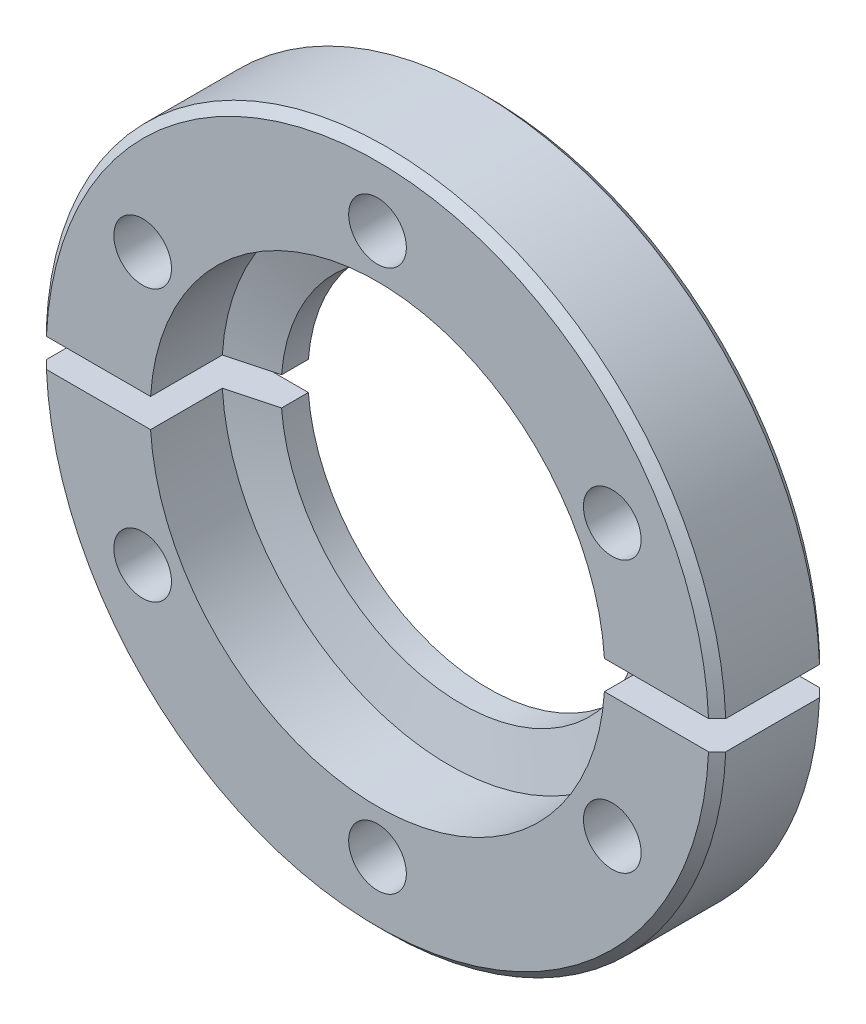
ISO-10303-21;
HEADER;
FILE_DESCRIPTION(('STEP AP214'),'2;1');
FILE_NAME('part.step','',(''),(''),'','','');
FILE_SCHEMA(('AUTOMOTIVE_DESIGN { 1 0 10303 214 1 1 1 1 }'));
ENDSEC;
DATA;
#1=APPLICATION_CONTEXT('core data for automotive mechanical design processes');
#2=APPLICATION_PROTOCOL_DEFINITION('international standard','automotive_design',2000,#1);
#3=PRODUCT_CONTEXT('',#1,'mechanical');
#4=PRODUCT('Part','Part','',(#3));
#5=PRODUCT_RELATED_PRODUCT_CATEGORY('part','',(#4));
#6=PRODUCT_DEFINITION_FORMATION('','',#4);
#7=PRODUCT_DEFINITION_CONTEXT('part definition',#1,'design');
#8=PRODUCT_DEFINITION('design','',#6,#7);
#9=PRODUCT_DEFINITION_SHAPE('','',#8);
#10=(LENGTH_UNIT() NAMED_UNIT(*) SI_UNIT(.MILLI.,.METRE.));
#11=(NAMED_UNIT(*) PLANE_ANGLE_UNIT() SI_UNIT($,.RADIAN.));
#12=(NAMED_UNIT(*) SI_UNIT($,.STERADIAN.) SOLID_ANGLE_UNIT());
#13=UNCERTAINTY_MEASURE_WITH_UNIT(LENGTH_MEASURE(1.E-05),#10,'distance_accuracy_value','');
#14=(GEOMETRIC_REPRESENTATION_CONTEXT(3) GLOBAL_UNCERTAINTY_ASSIGNED_CONTEXT((#13)) GLOBAL_UNIT_ASSIGNED_CONTEXT((#10,
#11,#12)) REPRESENTATION_CONTEXT('',''));
#15=CARTESIAN_POINT('',(0.,0.,0.));
#16=DIRECTION('',(0.,0.,1.));
#17=DIRECTION('',(1.,0.,0.));
#18=AXIS2_PLACEMENT_3D('',#15,#16,#17);
#19=CARTESIAN_POINT('',(0.,0.,9.0677999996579));
#20=DIRECTION('',(0.,0.,-1.));
#21=DIRECTION('',(-1.,0.,0.));
#22=AXIS2_PLACEMENT_3D('',#19,#20,#21);
#23=CONICAL_SURFACE('',#22,30.0989999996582,0.7853981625);
#24=CARTESIAN_POINT('',(-29.3094979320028,-1.2700000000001,9.82980000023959));
#25=CARTESIAN_POINT('',(-29.4366155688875,-1.27000000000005,9.7028014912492));
#26=CARTESIAN_POINT('',(-29.5637324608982,-1.27000000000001,9.57580223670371));
#27=CARTESIAN_POINT('',(-29.8179647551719,-1.26999999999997,9.32180223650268));
#28=CARTESIAN_POINT('',(-29.9450801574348,-1.26999999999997,9.19480149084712));
#29=CARTESIAN_POINT('',(-30.0721948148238,-1.26999999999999,9.06779999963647));
#30=B_SPLINE_CURVE_WITH_KNOTS('',3,(#24,#25,#26,#27,#28,#29),.UNSPECIFIED.,.F.,.F.,(4,2,4),(0.,
0.53906180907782,1.07812361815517),.UNSPECIFIED.);
#31=CARTESIAN_POINT('',(-29.3094979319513,-1.26999999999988,9.82980000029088));
#32=VERTEX_POINT('',#31);
#33=CARTESIAN_POINT('',(-30.0721948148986,-1.27000000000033,9.06779999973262));
#34=VERTEX_POINT('',#33);
#35=EDGE_CURVE('P0_E92',#32,#34,#30,.T.);
#36=ORIENTED_EDGE('',*,*,#35,.T.);
#37=CARTESIAN_POINT('',(1.11022302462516E-13,1.11022302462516E-13,9.06779999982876));
#38=DIRECTION('',(0.,0.,1.));
#39=DIRECTION('',(1.,0.,0.));
#40=AXIS2_PLACEMENT_3D('',#37,#38,#39);
#41=CIRCLE('',#40,30.099);
#42=CARTESIAN_POINT('',(30.0721948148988,-1.26999999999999,9.06779999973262));
#43=VERTEX_POINT('',#42);
#44=EDGE_CURVE('P0_E90',#43,#34,#41,.F.);
#45=ORIENTED_EDGE('',*,*,#44,.F.);
#46=CARTESIAN_POINT('',(30.0721948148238,-1.26999999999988,9.06779999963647));
#47=CARTESIAN_POINT('',(29.9450801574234,-1.26999999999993,9.19480149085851));
#48=CARTESIAN_POINT('',(29.8179647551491,-1.26999999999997,9.32180223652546));
#49=CARTESIAN_POINT('',(29.5637324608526,-1.27,9.57580223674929));
#50=CARTESIAN_POINT('',(29.4366155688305,-1.27000000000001,9.70280149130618));
#51=CARTESIAN_POINT('',(29.3094979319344,-1.26999999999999,9.82980000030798));
#52=B_SPLINE_CURVE_WITH_KNOTS('',3,(#46,#47,#48,#49,#50,#51),.UNSPECIFIED.,.F.,.F.,(4,2,4),(0.,
0.539061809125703,1.07812361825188),.UNSPECIFIED.);
#53=CARTESIAN_POINT('',(29.3094979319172,-1.2700000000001,9.82980000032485));
#54=VERTEX_POINT('',#53);
#55=EDGE_CURVE('P0_E20',#43,#54,#52,.T.);
#56=ORIENTED_EDGE('',*,*,#55,.T.);
#57=CARTESIAN_POINT('',(0.,0.,9.82980000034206));
#58=DIRECTION('',(0.,0.,-1.));
#59=DIRECTION('',(-1.,0.,0.));
#60=AXIS2_PLACEMENT_3D('',#57,#58,#59);
#61=CIRCLE('',#60,29.3370000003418);
#62=EDGE_CURVE('P0_E87',#54,#32,#61,.T.);
#63=ORIENTED_EDGE('',*,*,#62,.T.);
#64=EDGE_LOOP('',(#36,#45,#56,#63));
#65=FACE_BOUND('',#64,.T.);
#66=ADVANCED_FACE('P0_F16',(#65),#23,.T.);
#67=CARTESIAN_POINT('',(0.,1.11022302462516E-13,9.82980000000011));
#68=DIRECTION('',(0.,0.,-1.));
#69=DIRECTION('',(0.,1.,0.));
#70=AXIS2_PLACEMENT_3D('',#67,#68,#69);
#71=CYLINDRICAL_SURFACE('',#70,20.1295);
#72=DIRECTION('',(0.,0.,-1.));
#73=VECTOR('',#72,1.);
#74=CARTESIAN_POINT('',(-20.0893969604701,-1.2700000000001,9.8298));
#75=LINE('',#74,#73);
#76=CARTESIAN_POINT('',(-20.089396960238,-1.26999999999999,3.47980000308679));
#77=VERTEX_POINT('',#76);
#78=CARTESIAN_POINT('',(-20.0893969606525,-1.26999999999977,9.8298));
#79=VERTEX_POINT('',#78);
#80=EDGE_CURVE('P0_E234',#77,#79,#75,.F.);
#81=ORIENTED_EDGE('',*,*,#80,.T.);
#82=CARTESIAN_POINT('',(0.,1.11022302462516E-13,9.82980000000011));
#83=DIRECTION('',(0.,0.,-1.));
#84=DIRECTION('',(0.,1.,0.));
#85=AXIS2_PLACEMENT_3D('',#82,#83,#84);
#86=CIRCLE('',#85,20.1295);
#87=CARTESIAN_POINT('',(20.089396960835,-1.27000000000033,9.82980000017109));
#88=VERTEX_POINT('',#87);
#89=EDGE_CURVE('P0_E101',#79,#88,#86,.F.);
#90=ORIENTED_EDGE('',*,*,#89,.T.);
#91=DIRECTION('',(0.,0.,-1.));
#92=VECTOR('',#91,1.);
#93=CARTESIAN_POINT('',(20.089396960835,-1.26999999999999,9.8298));
#94=LINE('',#93,#92);
#95=CARTESIAN_POINT('',(20.0893969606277,-1.2700000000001,3.47980000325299));
#96=VERTEX_POINT('',#95);
#97=EDGE_CURVE('P0_E106',#88,#96,#94,.T.);
#98=ORIENTED_EDGE('',*,*,#97,.T.);
#99=CARTESIAN_POINT('',(0.,1.11022302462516E-13,3.4798000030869));
#100=DIRECTION('',(0.,0.,1.));
#101=DIRECTION('',(-1.,0.,0.));
#102=AXIS2_PLACEMENT_3D('',#99,#100,#101);
#103=CIRCLE('',#102,20.1294999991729);
#104=EDGE_CURVE('P0_E169',#96,#77,#103,.F.);
#105=ORIENTED_EDGE('',*,*,#104,.T.);
#106=EDGE_LOOP('',(#81,#90,#98,#105));
#107=FACE_BOUND('',#106,.T.);
#108=ADVANCED_FACE('P0_F249',(#107),#71,.F.);
#109=CARTESIAN_POINT('',(0.,1.11022302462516E-13,9.82980000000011));
#110=DIRECTION('',(0.,0.,-1.));
#111=DIRECTION('',(-1.,0.,0.));
#112=AXIS2_PLACEMENT_3D('',#109,#110,#111);
#113=PLANE('',#112);
#114=DIRECTION('',(1.,0.,0.));
#115=VECTOR('',#114,1.);
#116=CARTESIAN_POINT('',(-37.5615757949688,-1.26999999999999,9.82980000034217));
#117=LINE('',#116,#115);
#118=EDGE_CURVE('P0_E97',#54,#88,#117,.F.);
#119=ORIENTED_EDGE('',*,*,#118,.T.);
#120=ORIENTED_EDGE('',*,*,#89,.F.);
#121=DIRECTION('',(1.,0.,0.));
#122=VECTOR('',#121,1.);
#123=CARTESIAN_POINT('',(-37.5615757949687,-1.26999999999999,9.8298));
#124=LINE('',#123,#122);
#125=EDGE_CURVE('P0_E100',#79,#32,#124,.F.);
#126=ORIENTED_EDGE('',*,*,#125,.T.);
#127=ORIENTED_EDGE('',*,*,#62,.F.);
#128=EDGE_LOOP('',(#119,#120,#126,#127));
#129=FACE_BOUND('',#128,.T.);
#130=CARTESIAN_POINT('',(0.,-24.0029999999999,9.82980000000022));
#131=DIRECTION('',(0.,0.,-1.));
#132=DIRECTION('',(-1.,0.,0.));
#133=AXIS2_PLACEMENT_3D('',#130,#131,#132);
#134=CIRCLE('',#133,2.5527);
#135=CARTESIAN_POINT('',(-2.55270000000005,-24.0029999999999,9.82980000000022));
#136=VERTEX_POINT('',#135);
#137=EDGE_CURVE('P0_E165',#136,#136,#134,.T.);
#138=ORIENTED_EDGE('',*,*,#137,.T.);
#139=EDGE_LOOP('',(#138));
#140=FACE_BOUND('',#139,.T.);
#141=CARTESIAN_POINT('',(-20.7872077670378,-12.0015000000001,9.82980000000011));
#142=DIRECTION('',(0.,0.,-1.));
#143=DIRECTION('',(-1.,0.,0.));
#144=AXIS2_PLACEMENT_3D('',#141,#142,#143);
#145=CIRCLE('',#144,2.5527);
#146=CARTESIAN_POINT('',(-23.3399077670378,-12.0015000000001,9.82980000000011));
#147=VERTEX_POINT('',#146);
#148=EDGE_CURVE('P0_E168',#147,#147,#145,.T.);
#149=ORIENTED_EDGE('',*,*,#148,.T.);
#150=EDGE_LOOP('',(#149));
#151=FACE_BOUND('',#150,.T.);
#152=CARTESIAN_POINT('',(20.7872077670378,-12.0015000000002,9.8298));
#153=DIRECTION('',(0.,0.,-1.));
#154=DIRECTION('',(0.,1.,0.));
#155=AXIS2_PLACEMENT_3D('',#152,#153,#154);
#156=CIRCLE('',#155,2.5527);
#157=CARTESIAN_POINT('',(20.7872077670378,-9.44880000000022,9.8298));
#158=VERTEX_POINT('',#157);
#159=EDGE_CURVE('P0_E117',#158,#158,#156,.T.);
#160=ORIENTED_EDGE('',*,*,#159,.T.);
#161=EDGE_LOOP('',(#160));
#162=FACE_BOUND('',#161,.T.);
#163=ADVANCED_FACE('P0_F95',(#129,#140,#151,#162),#113,.F.);
#164=CARTESIAN_POINT('',(0.,0.,0.));
#165=DIRECTION('',(0.,0.,1.));
#166=DIRECTION('',(1.,0.,0.));
#167=AXIS2_PLACEMENT_3D('',#164,#165,#166);
#168=CYLINDRICAL_SURFACE('',#167,30.099);
#169=DIRECTION('',(0.,0.,-1.));
#170=VECTOR('',#169,1.);
#171=CARTESIAN_POINT('',(-30.0721948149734,-1.26999999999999,9.8298));
#172=LINE('',#171,#170);
#173=CARTESIAN_POINT('',(-30.0721948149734,-1.2700000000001,0.762000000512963));
#174=VERTEX_POINT('',#173);
#175=EDGE_CURVE('P0_E239',#34,#174,#172,.T.);
#176=ORIENTED_EDGE('',*,*,#175,.T.);
#177=CARTESIAN_POINT('',(0.,-1.11022302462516E-13,0.762000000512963));
#178=DIRECTION('',(0.,0.,1.));
#179=DIRECTION('',(-1.,0.,0.));
#180=AXIS2_PLACEMENT_3D('',#177,#178,#179);
#181=CIRCLE('',#180,30.098999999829);
#182=CARTESIAN_POINT('',(30.0721948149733,-1.2700000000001,0.762000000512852));
#183=VERTEX_POINT('',#182);
#184=EDGE_CURVE('P0_E111',#183,#174,#181,.F.);
#185=ORIENTED_EDGE('',*,*,#184,.F.);
#186=DIRECTION('',(0.,0.,-1.));
#187=VECTOR('',#186,1.);
#188=CARTESIAN_POINT('',(30.0721948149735,-1.2700000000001,9.8298));
#189=LINE('',#188,#187);
#190=EDGE_CURVE('P0_E108',#183,#43,#189,.F.);
#191=ORIENTED_EDGE('',*,*,#190,.T.);
#192=ORIENTED_EDGE('',*,*,#44,.T.);
#193=EDGE_LOOP('',(#176,#185,#191,#192));
#194=FACE_BOUND('',#193,.T.);
#195=ADVANCED_FACE('P0_F199',(#194),#168,.T.);
#196=CARTESIAN_POINT('',(0.,2.22044604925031E-13,3.47980000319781));
#197=DIRECTION('',(0.,0.,1.));
#198=DIRECTION('',(1.,0.,0.));
#199=AXIS2_PLACEMENT_3D('',#196,#197,#198);
#200=CONICAL_SURFACE('',#199,20.1294999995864,1.3089969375);
#201=ORIENTED_EDGE('',*,*,#104,.F.);
#202=CARTESIAN_POINT('',(20.0893969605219,-1.27000000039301,3.47980000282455));
#203=CARTESIAN_POINT('',(19.3997778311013,-1.27000000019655,3.29537437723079));
#204=CARTESIAN_POINT('',(18.7101454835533,-1.27000000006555,3.11099820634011));
#205=CARTESIAN_POINT('',(17.3308543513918,-1.26999999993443,2.74234477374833));
#206=CARTESIAN_POINT('',(16.6411955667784,-1.26999999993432,2.55806751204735));
#207=CARTESIAN_POINT('',(15.9515235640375,-1.26999999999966,2.37383970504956));
#208=B_SPLINE_CURVE_WITH_KNOTS('',3,(#202,#203,#204,#205,#206,#207),.UNSPECIFIED.,.F.,.F.,(4,2,
4),(0.,2.14156160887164,4.28312322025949),.UNSPECIFIED.);
#209=CARTESIAN_POINT('',(15.9515235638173,-1.2700000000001,2.37383970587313));
#210=VERTEX_POINT('',#209);
#211=EDGE_CURVE('P0_E113',#96,#210,#208,.T.);
#212=ORIENTED_EDGE('',*,*,#211,.T.);
#213=CARTESIAN_POINT('',(0.,1.11022302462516E-13,2.37383970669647));
#214=DIRECTION('',(0.,0.,-1.));
#215=DIRECTION('',(-1.,0.,0.));
#216=AXIS2_PLACEMENT_3D('',#213,#214,#215);
#217=CIRCLE('',#216,16.002);
#218=CARTESIAN_POINT('',(-15.9515235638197,-1.2699999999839,2.37383970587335));
#219=VERTEX_POINT('',#218);
#220=EDGE_CURVE('P0_E132',#210,#219,#217,.T.);
#221=ORIENTED_EDGE('',*,*,#220,.T.);
#222=CARTESIAN_POINT('',(-15.9515235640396,-1.2700000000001,2.37383970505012));
#223=CARTESIAN_POINT('',(-16.641195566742,-1.27000000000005,2.5580675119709));
#224=CARTESIAN_POINT('',(-17.3308543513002,-1.27000000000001,2.74234477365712));
#225=CARTESIAN_POINT('',(-18.7101454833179,-1.26999999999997,3.11099820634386));
#226=CARTESIAN_POINT('',(-19.3997778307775,-1.26999999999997,3.29537437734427));
#227=CARTESIAN_POINT('',(-20.089396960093,-1.26999999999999,3.47980000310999));
#228=B_SPLINE_CURVE_WITH_KNOTS('',3,(#222,#223,#224,#225,#226,#227),.UNSPECIFIED.,.F.,.F.,(4,2,
4),(0.,2.14156161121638,4.28312321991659),.UNSPECIFIED.);
#229=EDGE_CURVE('P0_E133',#219,#77,#228,.T.);
#230=ORIENTED_EDGE('',*,*,#229,.T.);
#231=EDGE_LOOP('',(#201,#212,#221,#230));
#232=FACE_BOUND('',#231,.T.);
#233=ADVANCED_FACE('P0_F146',(#232),#200,.F.);
#234=CARTESIAN_POINT('',(0.,-24.003,9.8298));
#235=DIRECTION('',(0.,0.,-1.));
#236=DIRECTION('',(-1.,0.,0.));
#237=AXIS2_PLACEMENT_3D('',#234,#235,#236);
#238=CYLINDRICAL_SURFACE('',#237,2.5527);
#239=ORIENTED_EDGE('',*,*,#137,.F.);
#240=EDGE_LOOP('',(#239));
#241=FACE_BOUND('',#240,.T.);
#242=CARTESIAN_POINT('',(0.,-24.0030000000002,1.11022302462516E-13));
#243=DIRECTION('',(0.,0.,-1.));
#244=DIRECTION('',(-1.,0.,0.));
#245=AXIS2_PLACEMENT_3D('',#242,#243,#244);
#246=CIRCLE('',#245,2.5527);
#247=CARTESIAN_POINT('',(-2.5527,-24.0030000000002,1.09357288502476E-13));
#248=VERTEX_POINT('',#247);
#249=EDGE_CURVE('P0_E129',#248,#248,#246,.F.);
#250=ORIENTED_EDGE('',*,*,#249,.F.);
#251=EDGE_LOOP('',(#250));
#252=FACE_BOUND('',#251,.T.);
#253=ADVANCED_FACE('P0_F191',(#241,#252),#238,.F.);
#254=CARTESIAN_POINT('',(-20.7872077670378,-12.0015000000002,9.8298));
#255=DIRECTION('',(0.,0.,-1.));
#256=DIRECTION('',(-1.,0.,0.));
#257=AXIS2_PLACEMENT_3D('',#254,#255,#256);
#258=CYLINDRICAL_SURFACE('',#257,2.5527);
#259=ORIENTED_EDGE('',*,*,#148,.F.);
#260=EDGE_LOOP('',(#259));
#261=FACE_BOUND('',#260,.T.);
#262=CARTESIAN_POINT('',(-20.7872077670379,-12.0015000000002,0.));
#263=DIRECTION('',(0.,0.,-1.));
#264=DIRECTION('',(-1.,0.,0.));
#265=AXIS2_PLACEMENT_3D('',#262,#263,#264);
#266=CIRCLE('',#265,2.5527);
#267=CARTESIAN_POINT('',(-23.3399077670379,-12.0015000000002,0.));
#268=VERTEX_POINT('',#267);
#269=EDGE_CURVE('P0_E126',#268,#268,#266,.F.);
#270=ORIENTED_EDGE('',*,*,#269,.F.);
#271=EDGE_LOOP('',(#270));
#272=FACE_BOUND('',#271,.T.);
#273=ADVANCED_FACE('P0_F188',(#261,#272),#258,.F.);
#274=CARTESIAN_POINT('',(20.7872077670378,-12.0015000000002,9.8298));
#275=DIRECTION('',(0.,0.,-1.));
#276=DIRECTION('',(0.,1.,0.));
#277=AXIS2_PLACEMENT_3D('',#274,#275,#276);
#278=CYLINDRICAL_SURFACE('',#277,2.5527);
#279=ORIENTED_EDGE('',*,*,#159,.F.);
#280=EDGE_LOOP('',(#279));
#281=FACE_BOUND('',#280,.T.);
#282=CARTESIAN_POINT('',(20.787207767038,-12.0015000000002,-1.11022302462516E-13));
#283=DIRECTION('',(0.,0.,-1.));
#284=DIRECTION('',(0.,1.,0.));
#285=AXIS2_PLACEMENT_3D('',#282,#283,#284);
#286=CIRCLE('',#285,2.5527);
#287=CARTESIAN_POINT('',(20.787207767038,-9.44880000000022,-1.08613346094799E-13));
#288=VERTEX_POINT('',#287);
#289=EDGE_CURVE('P0_E123',#288,#288,#286,.F.);
#290=ORIENTED_EDGE('',*,*,#289,.F.);
#291=EDGE_LOOP('',(#290));
#292=FACE_BOUND('',#291,.T.);
#293=ADVANCED_FACE('P0_F183',(#281,#292),#278,.F.);
#294=CARTESIAN_POINT('',(-37.5615757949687,-1.26999999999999,9.8298));
#295=DIRECTION('',(0.,-1.,0.));
#296=DIRECTION('',(0.,0.,-1.));
#297=AXIS2_PLACEMENT_3D('',#294,#295,#296);
#298=PLANE('',#297);
#299=ORIENTED_EDGE('',*,*,#55,.F.);
#300=ORIENTED_EDGE('',*,*,#190,.F.);
#301=CARTESIAN_POINT('',(29.3094979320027,-1.2700000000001,-2.39586128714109E-10));
#302=CARTESIAN_POINT('',(29.4366155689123,-1.27000000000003,0.12699850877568));
#303=CARTESIAN_POINT('',(29.563732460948,-1.26999999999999,0.253997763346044));
#304=CARTESIAN_POINT('',(29.8179647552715,-1.26999999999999,0.507997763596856));
#305=CARTESIAN_POINT('',(29.9450801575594,-1.27000000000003,0.634998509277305));
#306=CARTESIAN_POINT('',(30.0721948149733,-1.2700000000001,0.762000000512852));
#307=B_SPLINE_CURVE_WITH_KNOTS('',3,(#301,#302,#303,#304,#305,#306),.UNSPECIFIED.,.F.,.F.,(4,2,
4),(0.,0.539061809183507,1.07812361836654),.UNSPECIFIED.);
#308=CARTESIAN_POINT('',(29.309497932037,-1.26999999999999,-2.05280237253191E-10));
#309=VERTEX_POINT('',#308);
#310=EDGE_CURVE('P0_E107',#309,#183,#307,.T.);
#311=ORIENTED_EDGE('',*,*,#310,.F.);
#312=DIRECTION('',(-1.,0.,0.));
#313=VECTOR('',#312,1.);
#314=CARTESIAN_POINT('',(0.,-1.2700000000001,1.11022302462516E-13));
#315=LINE('',#314,#313);
#316=CARTESIAN_POINT('',(15.9515235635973,-1.26999999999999,2.22044604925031E-13));
#317=VERTEX_POINT('',#316);
#318=EDGE_CURVE('P0_E122',#317,#309,#315,.F.);
#319=ORIENTED_EDGE('',*,*,#318,.F.);
#320=DIRECTION('',(0.,0.,-1.));
#321=VECTOR('',#320,1.);
#322=CARTESIAN_POINT('',(15.9515235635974,-1.26999999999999,2.37383970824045));
#323=LINE('',#322,#321);
#324=EDGE_CURVE('P0_E226',#317,#210,#323,.F.);
#325=ORIENTED_EDGE('',*,*,#324,.T.);
#326=ORIENTED_EDGE('',*,*,#211,.F.);
#327=ORIENTED_EDGE('',*,*,#97,.F.);
#328=ORIENTED_EDGE('',*,*,#118,.F.);
#329=EDGE_LOOP('',(#299,#300,#311,#319,#325,#326,#327,#328));
#330=FACE_BOUND('',#329,.T.);
#331=ADVANCED_FACE('P0_F103',(#330),#298,.F.);
#332=CARTESIAN_POINT('',(1.11022302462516E-13,1.11022302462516E-13,0.762000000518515));
#333=DIRECTION('',(0.,0.,1.));
#334=DIRECTION('',(0.,-1.,0.));
#335=AXIS2_PLACEMENT_3D('',#332,#333,#334);
#336=CONICAL_SURFACE('',#335,30.0989999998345,0.7853981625);
#337=CARTESIAN_POINT('',(-30.0721948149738,-1.2700000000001,0.762000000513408));
#338=CARTESIAN_POINT('',(-29.9450801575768,-1.27000000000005,0.634998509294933));
#339=CARTESIAN_POINT('',(-29.817964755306,-1.27000000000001,0.507997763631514));
#340=CARTESIAN_POINT('',(-29.5637324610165,-1.26999999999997,0.253997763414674));
#341=CARTESIAN_POINT('',(-29.4366155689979,-1.26999999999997,0.126998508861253));
#342=CARTESIAN_POINT('',(-29.3094979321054,-1.26999999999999,-1.37112543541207E-10));
#343=B_SPLINE_CURVE_WITH_KNOTS('',3,(#337,#338,#339,#340,#341,#342),.UNSPECIFIED.,.F.,.F.,(4,2,
4),(0.,0.539061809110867,1.07812361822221),.UNSPECIFIED.);
#344=CARTESIAN_POINT('',(-29.3094979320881,-1.2700000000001,-1.53876911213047E-10));
#345=VERTEX_POINT('',#344);
#346=EDGE_CURVE('P0_E141',#174,#345,#343,.T.);
#347=ORIENTED_EDGE('',*,*,#346,.T.);
#348=CARTESIAN_POINT('',(0.,1.11022302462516E-13,-1.71085368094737E-10));
#349=DIRECTION('',(0.,0.,1.));
#350=DIRECTION('',(0.,-1.,0.));
#351=AXIS2_PLACEMENT_3D('',#348,#349,#350);
#352=CIRCLE('',#351,29.3370000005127);
#353=EDGE_CURVE('P0_E119',#309,#345,#352,.F.);
#354=ORIENTED_EDGE('',*,*,#353,.F.);
#355=ORIENTED_EDGE('',*,*,#310,.T.);
#356=ORIENTED_EDGE('',*,*,#184,.T.);
#357=EDGE_LOOP('',(#347,#354,#355,#356));
#358=FACE_BOUND('',#357,.T.);
#359=ADVANCED_FACE('P0_F155',(#358),#336,.T.);
#360=CARTESIAN_POINT('',(-37.5615757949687,-1.26999999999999,9.8298));
#361=DIRECTION('',(0.,-1.,0.));
#362=DIRECTION('',(0.,0.,-1.));
#363=AXIS2_PLACEMENT_3D('',#360,#361,#362);
#364=PLANE('',#363);
#365=DIRECTION('',(0.,0.,-1.));
#366=VECTOR('',#365,1.);
#367=CARTESIAN_POINT('',(-15.9515235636,-1.26999999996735,2.37383970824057));
#368=LINE('',#367,#366);
#369=CARTESIAN_POINT('',(-15.9515235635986,-1.2699999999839,-1.11022302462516E-13));
#370=VERTEX_POINT('',#369);
#371=EDGE_CURVE('P0_E39',#219,#370,#368,.T.);
#372=ORIENTED_EDGE('',*,*,#371,.T.);
#373=DIRECTION('',(-1.,0.,0.));
#374=VECTOR('',#373,1.);
#375=CARTESIAN_POINT('',(0.,-1.2700000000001,1.11022302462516E-13));
#376=LINE('',#375,#374);
#377=EDGE_CURVE('P0_E30',#345,#370,#376,.F.);
#378=ORIENTED_EDGE('',*,*,#377,.F.);
#379=ORIENTED_EDGE('',*,*,#346,.F.);
#380=ORIENTED_EDGE('',*,*,#175,.F.);
#381=ORIENTED_EDGE('',*,*,#35,.F.);
#382=ORIENTED_EDGE('',*,*,#125,.F.);
#383=ORIENTED_EDGE('',*,*,#80,.F.);
#384=ORIENTED_EDGE('',*,*,#229,.F.);
#385=EDGE_LOOP('',(#372,#378,#379,#380,#381,#382,#383,#384));
#386=FACE_BOUND('',#385,.T.);
#387=ADVANCED_FACE('P0_F150',(#386),#364,.F.);
#388=CARTESIAN_POINT('',(0.,-1.11022302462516E-13,2.37383970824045));
#389=DIRECTION('',(0.,0.,-1.));
#390=DIRECTION('',(-1.,0.,0.));
#391=AXIS2_PLACEMENT_3D('',#388,#389,#390);
#392=CYLINDRICAL_SURFACE('',#391,16.002);
#393=ORIENTED_EDGE('',*,*,#324,.F.);
#394=CARTESIAN_POINT('',(0.,0.,0.));
#395=DIRECTION('',(0.,0.,-1.));
#396=DIRECTION('',(-1.,0.,0.));
#397=AXIS2_PLACEMENT_3D('',#394,#395,#396);
#398=CIRCLE('',#397,16.002);
#399=EDGE_CURVE('P0_E11',#370,#317,#398,.F.);
#400=ORIENTED_EDGE('',*,*,#399,.F.);
#401=ORIENTED_EDGE('',*,*,#371,.F.);
#402=ORIENTED_EDGE('',*,*,#220,.F.);
#403=EDGE_LOOP('',(#393,#400,#401,#402));
#404=FACE_BOUND('',#403,.T.);
#405=ADVANCED_FACE('P0_F154',(#404),#392,.F.);
#406=CARTESIAN_POINT('',(0.,0.,0.));
#407=DIRECTION('',(0.,0.,-1.));
#408=DIRECTION('',(-1.,0.,0.));
#409=AXIS2_PLACEMENT_3D('',#406,#407,#408);
#410=PLANE('',#409);
#411=ORIENTED_EDGE('',*,*,#377,.T.);
#412=ORIENTED_EDGE('',*,*,#399,.T.);
#413=ORIENTED_EDGE('',*,*,#318,.T.);
#414=ORIENTED_EDGE('',*,*,#353,.T.);
#415=EDGE_LOOP('',(#411,#412,#413,#414));
#416=FACE_BOUND('',#415,.T.);
#417=ORIENTED_EDGE('',*,*,#289,.T.);
#418=EDGE_LOOP('',(#417));
#419=FACE_BOUND('',#418,.T.);
#420=ORIENTED_EDGE('',*,*,#269,.T.);
#421=EDGE_LOOP('',(#420));
#422=FACE_BOUND('',#421,.T.);
#423=ORIENTED_EDGE('',*,*,#249,.T.);
#424=EDGE_LOOP('',(#423));
#425=FACE_BOUND('',#424,.T.);
#426=ADVANCED_FACE('P0_F203',(#416,#419,#422,#425),#410,.T.);
#427=CLOSED_SHELL('',(#66,#108,#163,#195,#233,#253,#273,#293,#331,#359,#387,#405,#426));
#428=MANIFOLD_SOLID_BREP('P0_B1',#427);
#429=CARTESIAN_POINT('',(1.11022302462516E-13,0.,9.0677999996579));
#430=DIRECTION('',(0.,0.,-1.));
#431=DIRECTION('',(-1.,0.,0.));
#432=AXIS2_PLACEMENT_3D('',#429,#430,#431);
#433=CONICAL_SURFACE('',#432,30.0989999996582,0.7853981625);
#434=CARTESIAN_POINT('',(29.3094979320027,1.26999999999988,9.82980000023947));
#435=CARTESIAN_POINT('',(29.4366155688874,1.26999999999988,9.70280149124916));
#436=CARTESIAN_POINT('',(29.5637324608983,1.26999999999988,9.57580223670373));
#437=CARTESIAN_POINT('',(29.817964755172,1.26999999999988,9.32180223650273));
#438=CARTESIAN_POINT('',(29.9450801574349,1.26999999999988,9.19480149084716));
#439=CARTESIAN_POINT('',(30.0721948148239,1.26999999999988,9.06779999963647));
#440=B_SPLINE_CURVE_WITH_KNOTS('',3,(#434,#435,#436,#437,#438,#439),.UNSPECIFIED.,.F.,.F.,(4,2,
4),(0.,0.539061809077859,1.07812361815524),.UNSPECIFIED.);
#441=CARTESIAN_POINT('',(29.3094979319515,1.26999999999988,9.82980000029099));
#442=VERTEX_POINT('',#441);
#443=CARTESIAN_POINT('',(30.0721948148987,1.2700000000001,9.06779999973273));
#444=VERTEX_POINT('',#443);
#445=EDGE_CURVE('P1_E94',#442,#444,#440,.T.);
#446=ORIENTED_EDGE('',*,*,#445,.T.);
#447=CARTESIAN_POINT('',(1.66533453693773E-13,0.,9.06779999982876));
#448=DIRECTION('',(0.,0.,1.));
#449=DIRECTION('',(1.,0.,0.));
#450=AXIS2_PLACEMENT_3D('',#447,#448,#449);
#451=CIRCLE('',#450,30.099);
#452=CARTESIAN_POINT('',(-30.0721948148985,1.26999999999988,9.06779999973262));
#453=VERTEX_POINT('',#452);
#454=EDGE_CURVE('P1_E92',#453,#444,#451,.F.);
#455=ORIENTED_EDGE('',*,*,#454,.F.);
#456=CARTESIAN_POINT('',(-30.0721948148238,1.26999999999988,9.06779999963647));
#457=CARTESIAN_POINT('',(-29.9450801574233,1.26999999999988,9.19480149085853));
#458=CARTESIAN_POINT('',(-29.817964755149,1.26999999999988,9.32180223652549));
#459=CARTESIAN_POINT('',(-29.5637324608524,1.26999999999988,9.57580223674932));
#460=CARTESIAN_POINT('',(-29.4366155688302,1.26999999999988,9.7028014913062));
#461=CARTESIAN_POINT('',(-29.3094979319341,1.26999999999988,9.82980000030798));
#462=B_SPLINE_CURVE_WITH_KNOTS('',3,(#456,#457,#458,#459,#460,#461),.UNSPECIFIED.,.F.,.F.,(4,2,
4),(0.,0.539061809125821,1.07812361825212),.UNSPECIFIED.);
#463=CARTESIAN_POINT('',(-29.3094979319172,1.26999999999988,9.82980000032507));
#464=VERTEX_POINT('',#463);
#465=EDGE_CURVE('P1_E22',#453,#464,#462,.T.);
#466=ORIENTED_EDGE('',*,*,#465,.T.);
#467=CARTESIAN_POINT('',(1.11022302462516E-13,-2.22044604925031E-13,9.82980000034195));
#468=DIRECTION('',(0.,0.,-1.));
#469=DIRECTION('',(-1.,0.,0.));
#470=AXIS2_PLACEMENT_3D('',#467,#468,#469);
#471=CIRCLE('',#470,29.3370000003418);
#472=EDGE_CURVE('P1_E89',#464,#442,#471,.T.);
#473=ORIENTED_EDGE('',*,*,#472,.T.);
#474=EDGE_LOOP('',(#446,#455,#466,#473));
#475=FACE_BOUND('',#474,.T.);
#476=ADVANCED_FACE('P1_F18',(#475),#433,.T.);
#477=CARTESIAN_POINT('',(2.22044604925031E-13,0.,9.8298));
#478=DIRECTION('',(0.,0.,-1.));
#479=DIRECTION('',(0.,1.,0.));
#480=AXIS2_PLACEMENT_3D('',#477,#478,#479);
#481=CYLINDRICAL_SURFACE('',#480,20.1295);
#482=DIRECTION('',(0.,0.,1.));
#483=VECTOR('',#482,1.);
#484=CARTESIAN_POINT('',(20.0893969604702,1.26999999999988,9.82979999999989));
#485=LINE('',#484,#483);
#486=CARTESIAN_POINT('',(20.0893969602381,1.26999999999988,3.47980000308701));
#487=VERTEX_POINT('',#486);
#488=CARTESIAN_POINT('',(20.0893969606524,1.26999999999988,9.82979999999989));
#489=VERTEX_POINT('',#488);
#490=EDGE_CURVE('P1_E236',#487,#489,#485,.T.);
#491=ORIENTED_EDGE('',*,*,#490,.T.);
#492=CARTESIAN_POINT('',(2.22044604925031E-13,0.,9.8298));
#493=DIRECTION('',(0.,0.,-1.));
#494=DIRECTION('',(0.,1.,0.));
#495=AXIS2_PLACEMENT_3D('',#492,#493,#494);
#496=CIRCLE('',#495,20.1295);
#497=CARTESIAN_POINT('',(-20.0893969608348,1.26999999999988,9.82980000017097));
#498=VERTEX_POINT('',#497);
#499=EDGE_CURVE('P1_E103',#489,#498,#496,.F.);
#500=ORIENTED_EDGE('',*,*,#499,.T.);
#501=DIRECTION('',(0.,0.,1.));
#502=VECTOR('',#501,1.);
#503=CARTESIAN_POINT('',(-20.0893969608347,1.26999999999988,9.82979999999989));
#504=LINE('',#503,#502);
#505=CARTESIAN_POINT('',(-20.0893969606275,1.26999999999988,3.4798000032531));
#506=VERTEX_POINT('',#505);
#507=EDGE_CURVE('P1_E108',#498,#506,#504,.F.);
#508=ORIENTED_EDGE('',*,*,#507,.T.);
#509=CARTESIAN_POINT('',(0.,0.,3.4798000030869));
#510=DIRECTION('',(0.,0.,1.));
#511=DIRECTION('',(1.,0.,0.));
#512=AXIS2_PLACEMENT_3D('',#509,#510,#511);
#513=CIRCLE('',#512,20.1294999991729);
#514=EDGE_CURVE('P1_E171',#506,#487,#513,.F.);
#515=ORIENTED_EDGE('',*,*,#514,.T.);
#516=EDGE_LOOP('',(#491,#500,#508,#515));
#517=FACE_BOUND('',#516,.T.);
#518=ADVANCED_FACE('P1_F251',(#517),#481,.F.);
#519=CARTESIAN_POINT('',(2.22044604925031E-13,0.,9.8298));
#520=DIRECTION('',(0.,0.,-1.));
#521=DIRECTION('',(-1.,0.,0.));
#522=AXIS2_PLACEMENT_3D('',#519,#520,#521);
#523=PLANE('',#522);
#524=DIRECTION('',(1.,0.,0.));
#525=VECTOR('',#524,1.);
#526=CARTESIAN_POINT('',(37.5615757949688,1.26999999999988,9.82980000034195));
#527=LINE('',#526,#525);
#528=EDGE_CURVE('P1_E99',#464,#498,#527,.T.);
#529=ORIENTED_EDGE('',*,*,#528,.T.);
#530=ORIENTED_EDGE('',*,*,#499,.F.);
#531=DIRECTION('',(1.,0.,0.));
#532=VECTOR('',#531,1.);
#533=CARTESIAN_POINT('',(37.5615757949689,1.26999999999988,9.8298));
#534=LINE('',#533,#532);
#535=EDGE_CURVE('P1_E102',#489,#442,#534,.T.);
#536=ORIENTED_EDGE('',*,*,#535,.T.);
#537=ORIENTED_EDGE('',*,*,#472,.F.);
#538=EDGE_LOOP('',(#529,#530,#536,#537));
#539=FACE_BOUND('',#538,.T.);
#540=CARTESIAN_POINT('',(0.,24.0030000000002,9.8298));
#541=DIRECTION('',(0.,0.,-1.));
#542=DIRECTION('',(-1.,0.,0.));
#543=AXIS2_PLACEMENT_3D('',#540,#541,#542);
#544=CIRCLE('',#543,2.5527);
#545=CARTESIAN_POINT('',(-2.55269999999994,24.0030000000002,9.8298));
#546=VERTEX_POINT('',#545);
#547=EDGE_CURVE('P1_E167',#546,#546,#544,.T.);
#548=ORIENTED_EDGE('',*,*,#547,.T.);
#549=EDGE_LOOP('',(#548));
#550=FACE_BOUND('',#549,.T.);
#551=CARTESIAN_POINT('',(20.7872077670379,12.0015,9.82980000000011));
#552=DIRECTION('',(0.,0.,-1.));
#553=DIRECTION('',(-1.,0.,0.));
#554=AXIS2_PLACEMENT_3D('',#551,#552,#553);
#555=CIRCLE('',#554,2.5527);
#556=CARTESIAN_POINT('',(18.2345077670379,12.0015,9.82980000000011));
#557=VERTEX_POINT('',#556);
#558=EDGE_CURVE('P1_E170',#557,#557,#555,.T.);
#559=ORIENTED_EDGE('',*,*,#558,.T.);
#560=EDGE_LOOP('',(#559));
#561=FACE_BOUND('',#560,.T.);
#562=CARTESIAN_POINT('',(-20.7872077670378,12.0015,9.8298));
#563=DIRECTION('',(0.,0.,-1.));
#564=DIRECTION('',(0.,1.,0.));
#565=AXIS2_PLACEMENT_3D('',#562,#563,#564);
#566=CIRCLE('',#565,2.5527);
#567=CARTESIAN_POINT('',(-20.7872077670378,14.5542,9.8298));
#568=VERTEX_POINT('',#567);
#569=EDGE_CURVE('P1_E119',#568,#568,#566,.T.);
#570=ORIENTED_EDGE('',*,*,#569,.T.);
#571=EDGE_LOOP('',(#570));
#572=FACE_BOUND('',#571,.T.);
#573=ADVANCED_FACE('P1_F97',(#539,#550,#561,#572),#523,.F.);
#574=CARTESIAN_POINT('',(0.,0.,0.));
#575=DIRECTION('',(0.,0.,1.));
#576=DIRECTION('',(1.,0.,0.));
#577=AXIS2_PLACEMENT_3D('',#574,#575,#576);
#578=CYLINDRICAL_SURFACE('',#577,30.099);
#579=DIRECTION('',(0.,0.,1.));
#580=VECTOR('',#579,1.);
#581=CARTESIAN_POINT('',(30.0721948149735,1.26999999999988,9.8298));
#582=LINE('',#581,#580);
#583=CARTESIAN_POINT('',(30.0721948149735,1.26999999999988,0.762000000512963));
#584=VERTEX_POINT('',#583);
#585=EDGE_CURVE('P1_E241',#444,#584,#582,.F.);
#586=ORIENTED_EDGE('',*,*,#585,.T.);
#587=CARTESIAN_POINT('',(0.,0.,0.762000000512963));
#588=DIRECTION('',(0.,0.,1.));
#589=DIRECTION('',(1.,0.,0.));
#590=AXIS2_PLACEMENT_3D('',#587,#588,#589);
#591=CIRCLE('',#590,30.098999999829);
#592=CARTESIAN_POINT('',(-30.0721948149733,1.26999999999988,0.762000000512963));
#593=VERTEX_POINT('',#592);
#594=EDGE_CURVE('P1_E113',#593,#584,#591,.F.);
#595=ORIENTED_EDGE('',*,*,#594,.F.);
#596=DIRECTION('',(0.,0.,1.));
#597=VECTOR('',#596,1.);
#598=CARTESIAN_POINT('',(-30.0721948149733,1.26999999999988,9.8298));
#599=LINE('',#598,#597);
#600=EDGE_CURVE('P1_E110',#593,#453,#599,.T.);
#601=ORIENTED_EDGE('',*,*,#600,.T.);
#602=ORIENTED_EDGE('',*,*,#454,.T.);
#603=EDGE_LOOP('',(#586,#595,#601,#602));
#604=FACE_BOUND('',#603,.T.);
#605=ADVANCED_FACE('P1_F201',(#604),#578,.T.);
#606=CARTESIAN_POINT('',(0.,0.,3.47980000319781));
#607=DIRECTION('',(0.,0.,1.));
#608=DIRECTION('',(1.,0.,0.));
#609=AXIS2_PLACEMENT_3D('',#606,#607,#608);
#610=CONICAL_SURFACE('',#609,20.1294999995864,1.3089969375);
#611=ORIENTED_EDGE('',*,*,#514,.F.);
#612=CARTESIAN_POINT('',(-20.0893969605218,1.2700000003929,3.47980000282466));
#613=CARTESIAN_POINT('',(-19.3997778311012,1.27000000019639,3.29537437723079));
#614=CARTESIAN_POINT('',(-18.7101454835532,1.27000000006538,3.11099820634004));
#615=CARTESIAN_POINT('',(-17.3308543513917,1.26999999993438,2.74234477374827));
#616=CARTESIAN_POINT('',(-16.6411955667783,1.26999999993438,2.55806751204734));
#617=CARTESIAN_POINT('',(-15.9515235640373,1.26999999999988,2.37383970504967));
#618=B_SPLINE_CURVE_WITH_KNOTS('',3,(#612,#613,#614,#615,#616,#617),.UNSPECIFIED.,.F.,.F.,(4,2,
4),(0.,2.14156160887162,4.28312322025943),.UNSPECIFIED.);
#619=CARTESIAN_POINT('',(-15.9515235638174,1.26999999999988,2.37383970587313));
#620=VERTEX_POINT('',#619);
#621=EDGE_CURVE('P1_E115',#506,#620,#618,.T.);
#622=ORIENTED_EDGE('',*,*,#621,.T.);
#623=CARTESIAN_POINT('',(0.,0.,2.37383970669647));
#624=DIRECTION('',(0.,0.,-1.));
#625=DIRECTION('',(-1.,0.,0.));
#626=AXIS2_PLACEMENT_3D('',#623,#624,#625);
#627=CIRCLE('',#626,16.002);
#628=CARTESIAN_POINT('',(15.9515235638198,1.26999999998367,2.37383970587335));
#629=VERTEX_POINT('',#628);
#630=EDGE_CURVE('P1_E134',#620,#629,#627,.T.);
#631=ORIENTED_EDGE('',*,*,#630,.T.);
#632=CARTESIAN_POINT('',(15.9515235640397,1.2700000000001,2.37383970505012));
#633=CARTESIAN_POINT('',(16.6411955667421,1.26999999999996,2.55806751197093));
#634=CARTESIAN_POINT('',(17.3308543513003,1.26999999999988,2.74234477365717));
#635=CARTESIAN_POINT('',(18.7101454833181,1.26999999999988,3.11099820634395));
#636=CARTESIAN_POINT('',(19.3997778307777,1.26999999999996,3.29537437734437));
#637=CARTESIAN_POINT('',(20.0893969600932,1.2700000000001,3.4798000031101));
#638=B_SPLINE_CURVE_WITH_KNOTS('',3,(#632,#633,#634,#635,#636,#637),.UNSPECIFIED.,.F.,.F.,(4,2,
4),(0.,2.14156161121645,4.28312321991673),.UNSPECIFIED.);
#639=EDGE_CURVE('P1_E135',#629,#487,#638,.T.);
#640=ORIENTED_EDGE('',*,*,#639,.T.);
#641=EDGE_LOOP('',(#611,#622,#631,#640));
#642=FACE_BOUND('',#641,.T.);
#643=ADVANCED_FACE('P1_F148',(#642),#610,.F.);
#644=CARTESIAN_POINT('',(0.,24.0030000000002,9.8298));
#645=DIRECTION('',(0.,0.,-1.));
#646=DIRECTION('',(-1.,0.,0.));
#647=AXIS2_PLACEMENT_3D('',#644,#645,#646);
#648=CYLINDRICAL_SURFACE('',#647,2.5527);
#649=ORIENTED_EDGE('',*,*,#547,.F.);
#650=EDGE_LOOP('',(#649));
#651=FACE_BOUND('',#650,.T.);
#652=CARTESIAN_POINT('',(0.,24.003,1.11022302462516E-13));
#653=DIRECTION('',(0.,0.,-1.));
#654=DIRECTION('',(-1.,0.,0.));
#655=AXIS2_PLACEMENT_3D('',#652,#653,#654);
#656=CIRCLE('',#655,2.5527);
#657=CARTESIAN_POINT('',(-2.5527,24.003,1.12576610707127E-13));
#658=VERTEX_POINT('',#657);
#659=EDGE_CURVE('P1_E131',#658,#658,#656,.F.);
#660=ORIENTED_EDGE('',*,*,#659,.F.);
#661=EDGE_LOOP('',(#660));
#662=FACE_BOUND('',#661,.T.);
#663=ADVANCED_FACE('P1_F193',(#651,#662),#648,.F.);
#664=CARTESIAN_POINT('',(20.7872077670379,12.0015,9.82980000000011));
#665=DIRECTION('',(0.,0.,-1.));
#666=DIRECTION('',(-1.,0.,0.));
#667=AXIS2_PLACEMENT_3D('',#664,#665,#666);
#668=CYLINDRICAL_SURFACE('',#667,2.5527);
#669=ORIENTED_EDGE('',*,*,#558,.F.);
#670=EDGE_LOOP('',(#669));
#671=FACE_BOUND('',#670,.T.);
#672=CARTESIAN_POINT('',(20.7872077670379,12.0015,-1.11022302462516E-13));
#673=DIRECTION('',(0.,0.,-1.));
#674=DIRECTION('',(-1.,0.,0.));
#675=AXIS2_PLACEMENT_3D('',#672,#673,#674);
#676=CIRCLE('',#675,2.5527);
#677=CARTESIAN_POINT('',(18.2345077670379,12.0015,-1.08617774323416E-13));
#678=VERTEX_POINT('',#677);
#679=EDGE_CURVE('P1_E128',#678,#678,#676,.F.);
#680=ORIENTED_EDGE('',*,*,#679,.F.);
#681=EDGE_LOOP('',(#680));
#682=FACE_BOUND('',#681,.T.);
#683=ADVANCED_FACE('P1_F190',(#671,#682),#668,.F.);
#684=CARTESIAN_POINT('',(-20.7872077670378,12.0015,9.8298));
#685=DIRECTION('',(0.,0.,-1.));
#686=DIRECTION('',(0.,1.,0.));
#687=AXIS2_PLACEMENT_3D('',#684,#685,#686);
#688=CYLINDRICAL_SURFACE('',#687,2.5527);
#689=ORIENTED_EDGE('',*,*,#569,.F.);
#690=EDGE_LOOP('',(#689));
#691=FACE_BOUND('',#690,.T.);
#692=CARTESIAN_POINT('',(-20.787207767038,12.0015,-1.11022302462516E-13));
#693=DIRECTION('',(0.,0.,-1.));
#694=DIRECTION('',(0.,1.,0.));
#695=AXIS2_PLACEMENT_3D('',#692,#693,#694);
#696=CIRCLE('',#695,2.5527);
#697=CARTESIAN_POINT('',(-20.787207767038,14.5542,-1.13546392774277E-13));
#698=VERTEX_POINT('',#697);
#699=EDGE_CURVE('P1_E125',#698,#698,#696,.F.);
#700=ORIENTED_EDGE('',*,*,#699,.F.);
#701=EDGE_LOOP('',(#700));
#702=FACE_BOUND('',#701,.T.);
#703=ADVANCED_FACE('P1_F185',(#691,#702),#688,.F.);
#704=CARTESIAN_POINT('',(37.5615757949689,1.26999999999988,9.8298));
#705=DIRECTION('',(0.,1.,0.));
#706=DIRECTION('',(0.,0.,1.));
#707=AXIS2_PLACEMENT_3D('',#704,#705,#706);
#708=PLANE('',#707);
#709=ORIENTED_EDGE('',*,*,#465,.F.);
#710=ORIENTED_EDGE('',*,*,#600,.F.);
#711=CARTESIAN_POINT('',(-29.3094979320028,1.26999999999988,-2.39364084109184E-10));
#712=CARTESIAN_POINT('',(-29.4366155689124,1.26999999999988,0.126998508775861));
#713=CARTESIAN_POINT('',(-29.563732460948,1.26999999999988,0.253997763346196));
#714=CARTESIAN_POINT('',(-29.8179647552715,1.26999999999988,0.507997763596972));
#715=CARTESIAN_POINT('',(-29.9450801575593,1.26999999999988,0.634998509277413));
#716=CARTESIAN_POINT('',(-30.0721948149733,1.26999999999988,0.762000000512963));
#717=B_SPLINE_CURVE_WITH_KNOTS('',3,(#711,#712,#713,#714,#715,#716),.UNSPECIFIED.,.F.,.F.,(4,2,
4),(0.,0.53906180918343,1.07812361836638),.UNSPECIFIED.);
#718=CARTESIAN_POINT('',(-29.309497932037,1.26999999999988,-2.05280237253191E-10));
#719=VERTEX_POINT('',#718);
#720=EDGE_CURVE('P1_E109',#719,#593,#717,.T.);
#721=ORIENTED_EDGE('',*,*,#720,.F.);
#722=DIRECTION('',(-1.,0.,0.));
#723=VECTOR('',#722,1.);
#724=CARTESIAN_POINT('',(1.11022302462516E-13,1.26999999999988,0.));
#725=LINE('',#724,#723);
#726=CARTESIAN_POINT('',(-15.9515235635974,1.26999999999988,0.));
#727=VERTEX_POINT('',#726);
#728=EDGE_CURVE('P1_E124',#727,#719,#725,.T.);
#729=ORIENTED_EDGE('',*,*,#728,.F.);
#730=DIRECTION('',(0.,0.,-1.));
#731=VECTOR('',#730,1.);
#732=CARTESIAN_POINT('',(-15.9515235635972,1.26999999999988,2.37383970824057));
#733=LINE('',#732,#731);
#734=EDGE_CURVE('P1_E228',#727,#620,#733,.F.);
#735=ORIENTED_EDGE('',*,*,#734,.T.);
#736=ORIENTED_EDGE('',*,*,#621,.F.);
#737=ORIENTED_EDGE('',*,*,#507,.F.);
#738=ORIENTED_EDGE('',*,*,#528,.F.);
#739=EDGE_LOOP('',(#709,#710,#721,#729,#735,#736,#737,#738));
#740=FACE_BOUND('',#739,.T.);
#741=ADVANCED_FACE('P1_F105',(#740),#708,.F.);
#742=CARTESIAN_POINT('',(0.,0.,0.762000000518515));
#743=DIRECTION('',(0.,0.,1.));
#744=DIRECTION('',(0.,-1.,0.));
#745=AXIS2_PLACEMENT_3D('',#742,#743,#744);
#746=CONICAL_SURFACE('',#745,30.0989999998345,0.7853981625);
#747=CARTESIAN_POINT('',(30.0721948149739,1.26999999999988,0.762000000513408));
#748=CARTESIAN_POINT('',(29.9450801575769,1.26999999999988,0.634998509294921));
#749=CARTESIAN_POINT('',(29.8179647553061,1.26999999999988,0.507997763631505));
#750=CARTESIAN_POINT('',(29.5637324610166,1.26999999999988,0.253997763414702));
#751=CARTESIAN_POINT('',(29.436615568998,1.26999999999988,0.126998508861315));
#752=CARTESIAN_POINT('',(29.3094979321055,1.26999999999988,-1.37001521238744E-10));
#753=B_SPLINE_CURVE_WITH_KNOTS('',3,(#747,#748,#749,#750,#751,#752),.UNSPECIFIED.,.F.,.F.,(4,2,
4),(0.,0.539061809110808,1.07812361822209),.UNSPECIFIED.);
#754=CARTESIAN_POINT('',(29.3094979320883,1.26999999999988,-1.54098955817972E-10));
#755=VERTEX_POINT('',#754);
#756=EDGE_CURVE('P1_E143',#584,#755,#753,.T.);
#757=ORIENTED_EDGE('',*,*,#756,.T.);
#758=CARTESIAN_POINT('',(0.,0.,-1.71085368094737E-10));
#759=DIRECTION('',(0.,0.,1.));
#760=DIRECTION('',(0.,-1.,0.));
#761=AXIS2_PLACEMENT_3D('',#758,#759,#760);
#762=CIRCLE('',#761,29.3370000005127);
#763=EDGE_CURVE('P1_E121',#719,#755,#762,.F.);
#764=ORIENTED_EDGE('',*,*,#763,.F.);
#765=ORIENTED_EDGE('',*,*,#720,.T.);
#766=ORIENTED_EDGE('',*,*,#594,.T.);
#767=EDGE_LOOP('',(#757,#764,#765,#766));
#768=FACE_BOUND('',#767,.T.);
#769=ADVANCED_FACE('P1_F157',(#768),#746,.T.);
#770=CARTESIAN_POINT('',(37.5615757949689,1.26999999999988,9.8298));
#771=DIRECTION('',(0.,1.,0.));
#772=DIRECTION('',(0.,0.,1.));
#773=AXIS2_PLACEMENT_3D('',#770,#771,#772);
#774=PLANE('',#773);
#775=DIRECTION('',(0.,0.,-1.));
#776=VECTOR('',#775,1.);
#777=CARTESIAN_POINT('',(15.9515235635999,1.26999999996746,2.37383970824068));
#778=LINE('',#777,#776);
#779=CARTESIAN_POINT('',(15.9515235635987,1.26999999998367,0.));
#780=VERTEX_POINT('',#779);
#781=EDGE_CURVE('P1_E41',#629,#780,#778,.T.);
#782=ORIENTED_EDGE('',*,*,#781,.T.);
#783=DIRECTION('',(-1.,0.,0.));
#784=VECTOR('',#783,1.);
#785=CARTESIAN_POINT('',(1.11022302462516E-13,1.26999999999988,0.));
#786=LINE('',#785,#784);
#787=EDGE_CURVE('P1_E32',#755,#780,#786,.T.);
#788=ORIENTED_EDGE('',*,*,#787,.F.);
#789=ORIENTED_EDGE('',*,*,#756,.F.);
#790=ORIENTED_EDGE('',*,*,#585,.F.);
#791=ORIENTED_EDGE('',*,*,#445,.F.);
#792=ORIENTED_EDGE('',*,*,#535,.F.);
#793=ORIENTED_EDGE('',*,*,#490,.F.);
#794=ORIENTED_EDGE('',*,*,#639,.F.);
#795=EDGE_LOOP('',(#782,#788,#789,#790,#791,#792,#793,#794));
#796=FACE_BOUND('',#795,.T.);
#797=ADVANCED_FACE('P1_F152',(#796),#774,.F.);
#798=CARTESIAN_POINT('',(0.,-2.22044604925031E-13,2.37383970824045));
#799=DIRECTION('',(0.,0.,-1.));
#800=DIRECTION('',(-1.,0.,0.));
#801=AXIS2_PLACEMENT_3D('',#798,#799,#800);
#802=CYLINDRICAL_SURFACE('',#801,16.002);
#803=ORIENTED_EDGE('',*,*,#734,.F.);
#804=CARTESIAN_POINT('',(0.,0.,0.));
#805=DIRECTION('',(0.,0.,-1.));
#806=DIRECTION('',(-1.,0.,0.));
#807=AXIS2_PLACEMENT_3D('',#804,#805,#806);
#808=CIRCLE('',#807,16.002);
#809=EDGE_CURVE('P1_E11',#780,#727,#808,.F.);
#810=ORIENTED_EDGE('',*,*,#809,.F.);
#811=ORIENTED_EDGE('',*,*,#781,.F.);
#812=ORIENTED_EDGE('',*,*,#630,.F.);
#813=EDGE_LOOP('',(#803,#810,#811,#812));
#814=FACE_BOUND('',#813,.T.);
#815=ADVANCED_FACE('P1_F156',(#814),#802,.F.);
#816=CARTESIAN_POINT('',(0.,0.,0.));
#817=DIRECTION('',(0.,0.,-1.));
#818=DIRECTION('',(-1.,0.,0.));
#819=AXIS2_PLACEMENT_3D('',#816,#817,#818);
#820=PLANE('',#819);
#821=ORIENTED_EDGE('',*,*,#787,.T.);
#822=ORIENTED_EDGE('',*,*,#809,.T.);
#823=ORIENTED_EDGE('',*,*,#728,.T.);
#824=ORIENTED_EDGE('',*,*,#763,.T.);
#825=EDGE_LOOP('',(#821,#822,#823,#824));
#826=FACE_BOUND('',#825,.T.);
#827=ORIENTED_EDGE('',*,*,#699,.T.);
#828=EDGE_LOOP('',(#827));
#829=FACE_BOUND('',#828,.T.);
#830=ORIENTED_EDGE('',*,*,#679,.T.);
#831=EDGE_LOOP('',(#830));
#832=FACE_BOUND('',#831,.T.);
#833=ORIENTED_EDGE('',*,*,#659,.T.);
#834=EDGE_LOOP('',(#833));
#835=FACE_BOUND('',#834,.T.);
#836=ADVANCED_FACE('P1_F205',(#826,#829,#832,#835),#820,.T.);
#837=CLOSED_SHELL('',(#476,#518,#573,#605,#643,#663,#683,#703,#741,#769,#797,#815,#836));
#838=MANIFOLD_SOLID_BREP('P1_B1',#837);
#839=ADVANCED_BREP_SHAPE_REPRESENTATION('',(#18,#428,#838),#14);
#840=SHAPE_DEFINITION_REPRESENTATION(#9,#839);
ENDSEC;
END-ISO-10303-21;
